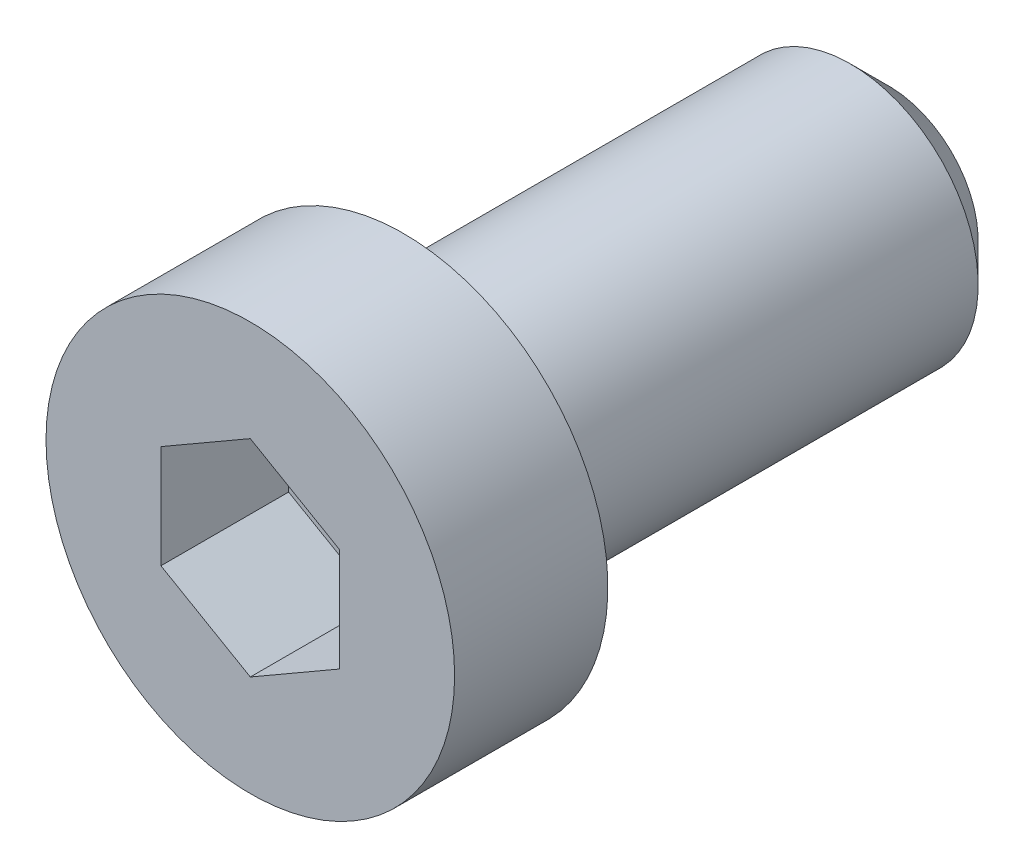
ISO-10303-21;
HEADER;
FILE_DESCRIPTION(('STEP AP214'),'2;1');
FILE_NAME('part.step','',(''),(''),'','','');
FILE_SCHEMA(('AUTOMOTIVE_DESIGN { 1 0 10303 214 1 1 1 1 }'));
ENDSEC;
DATA;
#1=APPLICATION_CONTEXT('core data for automotive mechanical design processes');
#2=APPLICATION_PROTOCOL_DEFINITION('international standard','automotive_design',2000,#1);
#3=PRODUCT_CONTEXT('',#1,'mechanical');
#4=PRODUCT('Part','Part','',(#3));
#5=PRODUCT_RELATED_PRODUCT_CATEGORY('part','',(#4));
#6=PRODUCT_DEFINITION_FORMATION('','',#4);
#7=PRODUCT_DEFINITION_CONTEXT('part definition',#1,'design');
#8=PRODUCT_DEFINITION('design','',#6,#7);
#9=PRODUCT_DEFINITION_SHAPE('','',#8);
#10=(LENGTH_UNIT() NAMED_UNIT(*) SI_UNIT(.MILLI.,.METRE.));
#11=(NAMED_UNIT(*) PLANE_ANGLE_UNIT() SI_UNIT($,.RADIAN.));
#12=(NAMED_UNIT(*) SI_UNIT($,.STERADIAN.) SOLID_ANGLE_UNIT());
#13=UNCERTAINTY_MEASURE_WITH_UNIT(LENGTH_MEASURE(1.E-05),#10,'distance_accuracy_value','');
#14=(GEOMETRIC_REPRESENTATION_CONTEXT(3) GLOBAL_UNCERTAINTY_ASSIGNED_CONTEXT((#13)) GLOBAL_UNIT_ASSIGNED_CONTEXT((#10,
#11,#12)) REPRESENTATION_CONTEXT('',''));
#15=CARTESIAN_POINT('',(0.,0.,0.));
#16=DIRECTION('',(0.,0.,1.));
#17=DIRECTION('',(1.,0.,0.));
#18=AXIS2_PLACEMENT_3D('',#15,#16,#17);
#19=CARTESIAN_POINT('',(0.,0.,0.));
#20=DIRECTION('',(0.,0.,-1.));
#21=DIRECTION('',(-1.,0.,0.));
#22=AXIS2_PLACEMENT_3D('',#19,#20,#21);
#23=CYLINDRICAL_SURFACE('',#22,8.);
#24=CARTESIAN_POINT('',(0.,0.,0.));
#25=DIRECTION('',(0.,0.,-1.));
#26=DIRECTION('',(-1.,0.,0.));
#27=AXIS2_PLACEMENT_3D('',#24,#25,#26);
#28=CIRCLE('',#27,8.);
#29=CARTESIAN_POINT('',(-8.,0.,0.));
#30=VERTEX_POINT('',#29);
#31=EDGE_CURVE('E128',#30,#30,#28,.T.);
#32=ORIENTED_EDGE('',*,*,#31,.F.);
#33=EDGE_LOOP('',(#32));
#34=FACE_BOUND('',#33,.T.);
#35=CARTESIAN_POINT('',(0.,0.,6.));
#36=DIRECTION('',(0.,0.,1.));
#37=DIRECTION('',(1.,0.,0.));
#38=AXIS2_PLACEMENT_3D('',#35,#36,#37);
#39=CIRCLE('',#38,8.);
#40=CARTESIAN_POINT('',(8.,0.,6.));
#41=VERTEX_POINT('',#40);
#42=EDGE_CURVE('E117',#41,#41,#39,.T.);
#43=ORIENTED_EDGE('',*,*,#42,.F.);
#44=EDGE_LOOP('',(#43));
#45=FACE_BOUND('',#44,.T.);
#46=ADVANCED_FACE('F14',(#34,#45),#23,.T.);
#47=CARTESIAN_POINT('',(0.,8.,0.));
#48=DIRECTION('',(0.,0.,1.));
#49=DIRECTION('',(1.,0.,0.));
#50=AXIS2_PLACEMENT_3D('',#47,#48,#49);
#51=PLANE('',#50);
#52=CARTESIAN_POINT('',(0.,0.,0.));
#53=DIRECTION('',(0.,0.,-1.));
#54=DIRECTION('',(-1.,0.,0.));
#55=AXIS2_PLACEMENT_3D('',#52,#53,#54);
#56=CIRCLE('',#55,5.);
#57=CARTESIAN_POINT('',(-5.,0.,0.));
#58=VERTEX_POINT('',#57);
#59=EDGE_CURVE('E125',#58,#58,#56,.T.);
#60=ORIENTED_EDGE('',*,*,#59,.F.);
#61=EDGE_LOOP('',(#60));
#62=FACE_BOUND('',#61,.T.);
#63=ORIENTED_EDGE('',*,*,#31,.T.);
#64=EDGE_LOOP('',(#63));
#65=FACE_BOUND('',#64,.T.);
#66=ADVANCED_FACE('F145',(#62,#65),#51,.F.);
#67=CARTESIAN_POINT('',(0.,0.,0.));
#68=DIRECTION('',(0.,0.,-1.));
#69=DIRECTION('',(-1.,0.,0.));
#70=AXIS2_PLACEMENT_3D('',#67,#68,#69);
#71=CYLINDRICAL_SURFACE('',#70,5.);
#72=CARTESIAN_POINT('',(0.,0.,-17.5));
#73=DIRECTION('',(0.,0.,-1.));
#74=DIRECTION('',(-1.,0.,0.));
#75=AXIS2_PLACEMENT_3D('',#72,#73,#74);
#76=CIRCLE('',#75,5.);
#77=CARTESIAN_POINT('',(-5.,0.,-17.5));
#78=VERTEX_POINT('',#77);
#79=EDGE_CURVE('E9',#78,#78,#76,.F.);
#80=ORIENTED_EDGE('',*,*,#79,.T.);
#81=EDGE_LOOP('',(#80));
#82=FACE_BOUND('',#81,.T.);
#83=ORIENTED_EDGE('',*,*,#59,.T.);
#84=EDGE_LOOP('',(#83));
#85=FACE_BOUND('',#84,.T.);
#86=ADVANCED_FACE('F151',(#82,#85),#71,.T.);
#87=CARTESIAN_POINT('',(0.,0.,6.));
#88=DIRECTION('',(0.,0.,1.));
#89=DIRECTION('',(1.,0.,0.));
#90=AXIS2_PLACEMENT_3D('',#87,#88,#89);
#91=PLANE('',#90);
#92=DIRECTION('',(0.866025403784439,-0.5,0.));
#93=VECTOR('',#92,1.);
#94=CARTESIAN_POINT('',(-3.5,-2.02072594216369,6.));
#95=LINE('',#94,#93);
#96=CARTESIAN_POINT('',(-3.5,-2.02072594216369,6.));
#97=VERTEX_POINT('',#96);
#98=CARTESIAN_POINT('',(0.,-4.04145188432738,6.));
#99=VERTEX_POINT('',#98);
#100=EDGE_CURVE('E30',#97,#99,#95,.T.);
#101=ORIENTED_EDGE('',*,*,#100,.F.);
#102=DIRECTION('',(0.,-1.,0.));
#103=VECTOR('',#102,1.);
#104=CARTESIAN_POINT('',(-3.5,2.02072594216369,6.));
#105=LINE('',#104,#103);
#106=CARTESIAN_POINT('',(-3.5,2.02072594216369,6.));
#107=VERTEX_POINT('',#106);
#108=EDGE_CURVE('E113',#107,#97,#105,.T.);
#109=ORIENTED_EDGE('',*,*,#108,.F.);
#110=DIRECTION('',(-0.866025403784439,-0.5,0.));
#111=VECTOR('',#110,1.);
#112=CARTESIAN_POINT('',(0.,4.04145188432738,6.));
#113=LINE('',#112,#111);
#114=CARTESIAN_POINT('',(0.,4.04145188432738,6.));
#115=VERTEX_POINT('',#114);
#116=EDGE_CURVE('E111',#115,#107,#113,.T.);
#117=ORIENTED_EDGE('',*,*,#116,.F.);
#118=DIRECTION('',(-0.866025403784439,0.5,0.));
#119=VECTOR('',#118,1.);
#120=CARTESIAN_POINT('',(3.5,2.02072594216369,6.));
#121=LINE('',#120,#119);
#122=CARTESIAN_POINT('',(3.5,2.02072594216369,6.));
#123=VERTEX_POINT('',#122);
#124=EDGE_CURVE('E78',#123,#115,#121,.T.);
#125=ORIENTED_EDGE('',*,*,#124,.F.);
#126=DIRECTION('',(0.,1.,0.));
#127=VECTOR('',#126,1.);
#128=CARTESIAN_POINT('',(3.5,-2.02072594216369,6.));
#129=LINE('',#128,#127);
#130=CARTESIAN_POINT('',(3.5,-2.02072594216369,6.));
#131=VERTEX_POINT('',#130);
#132=EDGE_CURVE('E107',#131,#123,#129,.T.);
#133=ORIENTED_EDGE('',*,*,#132,.F.);
#134=DIRECTION('',(0.866025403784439,0.5,0.));
#135=VECTOR('',#134,1.);
#136=CARTESIAN_POINT('',(0.,-4.04145188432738,6.));
#137=LINE('',#136,#135);
#138=EDGE_CURVE('E104',#99,#131,#137,.T.);
#139=ORIENTED_EDGE('',*,*,#138,.F.);
#140=EDGE_LOOP('',(#101,#109,#117,#125,#133,#139));
#141=FACE_BOUND('',#140,.T.);
#142=ORIENTED_EDGE('',*,*,#42,.T.);
#143=EDGE_LOOP('',(#142));
#144=FACE_BOUND('',#143,.T.);
#145=ADVANCED_FACE('F159',(#141,#144),#91,.T.);
#146=CARTESIAN_POINT('',(-3.5,-2.02072594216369,1.));
#147=DIRECTION('',(-0.5,-0.866025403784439,0.));
#148=DIRECTION('',(0.866025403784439,-0.5,0.));
#149=AXIS2_PLACEMENT_3D('',#146,#147,#148);
#150=PLANE('',#149);
#151=ORIENTED_EDGE('',*,*,#100,.T.);
#152=DIRECTION('',(0.,0.,1.));
#153=VECTOR('',#152,1.);
#154=CARTESIAN_POINT('',(0.,-4.04145188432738,1.));
#155=LINE('',#154,#153);
#156=CARTESIAN_POINT('',(0.,-4.04145188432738,1.));
#157=VERTEX_POINT('',#156);
#158=EDGE_CURVE('E60',#157,#99,#155,.T.);
#159=ORIENTED_EDGE('',*,*,#158,.F.);
#160=DIRECTION('',(0.866025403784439,-0.5,0.));
#161=VECTOR('',#160,1.);
#162=CARTESIAN_POINT('',(-3.5,-2.02072594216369,1.));
#163=LINE('',#162,#161);
#164=CARTESIAN_POINT('',(-3.5,-2.02072594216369,1.));
#165=VERTEX_POINT('',#164);
#166=EDGE_CURVE('E115',#165,#157,#163,.T.);
#167=ORIENTED_EDGE('',*,*,#166,.F.);
#168=DIRECTION('',(0.,0.,1.));
#169=VECTOR('',#168,1.);
#170=CARTESIAN_POINT('',(-3.5,-2.02072594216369,1.));
#171=LINE('',#170,#169);
#172=EDGE_CURVE('E38',#165,#97,#171,.T.);
#173=ORIENTED_EDGE('',*,*,#172,.T.);
#174=EDGE_LOOP('',(#151,#159,#167,#173));
#175=FACE_BOUND('',#174,.T.);
#176=ADVANCED_FACE('F163',(#175),#150,.F.);
#177=CARTESIAN_POINT('',(-3.5,2.02072594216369,1.));
#178=DIRECTION('',(-1.,0.,0.));
#179=DIRECTION('',(0.,0.,1.));
#180=AXIS2_PLACEMENT_3D('',#177,#178,#179);
#181=PLANE('',#180);
#182=ORIENTED_EDGE('',*,*,#108,.T.);
#183=ORIENTED_EDGE('',*,*,#172,.F.);
#184=DIRECTION('',(0.,-1.,0.));
#185=VECTOR('',#184,1.);
#186=CARTESIAN_POINT('',(-3.5,2.02072594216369,1.));
#187=LINE('',#186,#185);
#188=CARTESIAN_POINT('',(-3.5,2.02072594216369,1.));
#189=VERTEX_POINT('',#188);
#190=EDGE_CURVE('E90',#189,#165,#187,.T.);
#191=ORIENTED_EDGE('',*,*,#190,.F.);
#192=DIRECTION('',(0.,0.,1.));
#193=VECTOR('',#192,1.);
#194=CARTESIAN_POINT('',(-3.5,2.02072594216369,1.));
#195=LINE('',#194,#193);
#196=EDGE_CURVE('E82',#189,#107,#195,.T.);
#197=ORIENTED_EDGE('',*,*,#196,.T.);
#198=EDGE_LOOP('',(#182,#183,#191,#197));
#199=FACE_BOUND('',#198,.T.);
#200=ADVANCED_FACE('F167',(#199),#181,.F.);
#201=CARTESIAN_POINT('',(0.,4.04145188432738,1.));
#202=DIRECTION('',(-0.5,0.866025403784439,0.));
#203=DIRECTION('',(-0.866025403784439,-0.5,0.));
#204=AXIS2_PLACEMENT_3D('',#201,#202,#203);
#205=PLANE('',#204);
#206=ORIENTED_EDGE('',*,*,#116,.T.);
#207=ORIENTED_EDGE('',*,*,#196,.F.);
#208=DIRECTION('',(-0.866025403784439,-0.5,0.));
#209=VECTOR('',#208,1.);
#210=CARTESIAN_POINT('',(0.,4.04145188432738,1.));
#211=LINE('',#210,#209);
#212=CARTESIAN_POINT('',(0.,4.04145188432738,1.));
#213=VERTEX_POINT('',#212);
#214=EDGE_CURVE('E86',#213,#189,#211,.T.);
#215=ORIENTED_EDGE('',*,*,#214,.F.);
#216=DIRECTION('',(0.,0.,1.));
#217=VECTOR('',#216,1.);
#218=CARTESIAN_POINT('',(0.,4.04145188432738,1.));
#219=LINE('',#218,#217);
#220=EDGE_CURVE('E71',#213,#115,#219,.T.);
#221=ORIENTED_EDGE('',*,*,#220,.T.);
#222=EDGE_LOOP('',(#206,#207,#215,#221));
#223=FACE_BOUND('',#222,.T.);
#224=ADVANCED_FACE('F87',(#223),#205,.F.);
#225=CARTESIAN_POINT('',(3.5,2.02072594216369,1.));
#226=DIRECTION('',(0.5,0.866025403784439,0.));
#227=DIRECTION('',(-0.866025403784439,0.5,0.));
#228=AXIS2_PLACEMENT_3D('',#225,#226,#227);
#229=PLANE('',#228);
#230=ORIENTED_EDGE('',*,*,#124,.T.);
#231=ORIENTED_EDGE('',*,*,#220,.F.);
#232=DIRECTION('',(-0.866025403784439,0.5,0.));
#233=VECTOR('',#232,1.);
#234=CARTESIAN_POINT('',(3.5,2.02072594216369,1.));
#235=LINE('',#234,#233);
#236=CARTESIAN_POINT('',(3.5,2.02072594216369,1.));
#237=VERTEX_POINT('',#236);
#238=EDGE_CURVE('E75',#237,#213,#235,.T.);
#239=ORIENTED_EDGE('',*,*,#238,.F.);
#240=DIRECTION('',(0.,0.,1.));
#241=VECTOR('',#240,1.);
#242=CARTESIAN_POINT('',(3.5,2.02072594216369,1.));
#243=LINE('',#242,#241);
#244=EDGE_CURVE('E83',#237,#123,#243,.T.);
#245=ORIENTED_EDGE('',*,*,#244,.T.);
#246=EDGE_LOOP('',(#230,#231,#239,#245));
#247=FACE_BOUND('',#246,.T.);
#248=ADVANCED_FACE('F73',(#247),#229,.F.);
#249=CARTESIAN_POINT('',(3.5,-2.02072594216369,1.));
#250=DIRECTION('',(1.,0.,0.));
#251=DIRECTION('',(0.,1.,0.));
#252=AXIS2_PLACEMENT_3D('',#249,#250,#251);
#253=PLANE('',#252);
#254=ORIENTED_EDGE('',*,*,#132,.T.);
#255=ORIENTED_EDGE('',*,*,#244,.F.);
#256=DIRECTION('',(0.,1.,0.));
#257=VECTOR('',#256,1.);
#258=CARTESIAN_POINT('',(3.5,-2.02072594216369,1.));
#259=LINE('',#258,#257);
#260=CARTESIAN_POINT('',(3.5,-2.02072594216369,1.));
#261=VERTEX_POINT('',#260);
#262=EDGE_CURVE('E96',#261,#237,#259,.T.);
#263=ORIENTED_EDGE('',*,*,#262,.F.);
#264=DIRECTION('',(0.,0.,1.));
#265=VECTOR('',#264,1.);
#266=CARTESIAN_POINT('',(3.5,-2.02072594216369,1.));
#267=LINE('',#266,#265);
#268=EDGE_CURVE('E120',#261,#131,#267,.T.);
#269=ORIENTED_EDGE('',*,*,#268,.T.);
#270=EDGE_LOOP('',(#254,#255,#263,#269));
#271=FACE_BOUND('',#270,.T.);
#272=ADVANCED_FACE('F171',(#271),#253,.F.);
#273=CARTESIAN_POINT('',(0.,-4.04145188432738,1.));
#274=DIRECTION('',(0.5,-0.866025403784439,0.));
#275=DIRECTION('',(0.866025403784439,0.5,0.));
#276=AXIS2_PLACEMENT_3D('',#273,#274,#275);
#277=PLANE('',#276);
#278=ORIENTED_EDGE('',*,*,#138,.T.);
#279=ORIENTED_EDGE('',*,*,#268,.F.);
#280=DIRECTION('',(0.866025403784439,0.5,0.));
#281=VECTOR('',#280,1.);
#282=CARTESIAN_POINT('',(0.,-4.04145188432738,1.));
#283=LINE('',#282,#281);
#284=EDGE_CURVE('E98',#157,#261,#283,.T.);
#285=ORIENTED_EDGE('',*,*,#284,.F.);
#286=ORIENTED_EDGE('',*,*,#158,.T.);
#287=EDGE_LOOP('',(#278,#279,#285,#286));
#288=FACE_BOUND('',#287,.T.);
#289=ADVANCED_FACE('F168',(#288),#277,.F.);
#290=CARTESIAN_POINT('',(0.,0.,1.));
#291=DIRECTION('',(0.,0.,1.));
#292=DIRECTION('',(1.,0.,0.));
#293=AXIS2_PLACEMENT_3D('',#290,#291,#292);
#294=PLANE('',#293);
#295=ORIENTED_EDGE('',*,*,#166,.T.);
#296=ORIENTED_EDGE('',*,*,#284,.T.);
#297=ORIENTED_EDGE('',*,*,#262,.T.);
#298=ORIENTED_EDGE('',*,*,#238,.T.);
#299=ORIENTED_EDGE('',*,*,#214,.T.);
#300=ORIENTED_EDGE('',*,*,#190,.T.);
#301=EDGE_LOOP('',(#295,#296,#297,#298,#299,#300));
#302=FACE_BOUND('',#301,.T.);
#303=ADVANCED_FACE('F93',(#302),#294,.T.);
#304=CARTESIAN_POINT('',(0.,0.,-19.));
#305=DIRECTION('',(0.,0.,-1.));
#306=DIRECTION('',(-1.,0.,0.));
#307=AXIS2_PLACEMENT_3D('',#304,#305,#306);
#308=PLANE('',#307);
#309=CARTESIAN_POINT('',(0.,0.,-19.));
#310=DIRECTION('',(0.,0.,-1.));
#311=DIRECTION('',(-1.,0.,0.));
#312=AXIS2_PLACEMENT_3D('',#309,#310,#311);
#313=CIRCLE('',#312,3.5);
#314=CARTESIAN_POINT('',(-3.5,0.,-19.));
#315=VERTEX_POINT('',#314);
#316=EDGE_CURVE('E23',#315,#315,#313,.T.);
#317=ORIENTED_EDGE('',*,*,#316,.T.);
#318=EDGE_LOOP('',(#317));
#319=FACE_BOUND('',#318,.T.);
#320=ADVANCED_FACE('F133',(#319),#308,.T.);
#321=CARTESIAN_POINT('',(0.,0.,-19.));
#322=DIRECTION('',(0.,0.,1.));
#323=DIRECTION('',(1.,0.,0.));
#324=AXIS2_PLACEMENT_3D('',#321,#322,#323);
#325=CONICAL_SURFACE('',#324,3.5,0.785398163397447);
#326=ORIENTED_EDGE('',*,*,#79,.F.);
#327=EDGE_LOOP('',(#326));
#328=FACE_BOUND('',#327,.T.);
#329=ORIENTED_EDGE('',*,*,#316,.F.);
#330=EDGE_LOOP('',(#329));
#331=FACE_BOUND('',#330,.T.);
#332=ADVANCED_FACE('F17',(#328,#331),#325,.T.);
#333=CLOSED_SHELL('',(#46,#66,#86,#145,#176,#200,#224,#248,#272,#289,#303,#320,#332));
#334=MANIFOLD_SOLID_BREP('B1',#333);
#335=ADVANCED_BREP_SHAPE_REPRESENTATION('',(#18,#334),#14);
#336=SHAPE_DEFINITION_REPRESENTATION(#9,#335);
ENDSEC;
END-ISO-10303-21;
